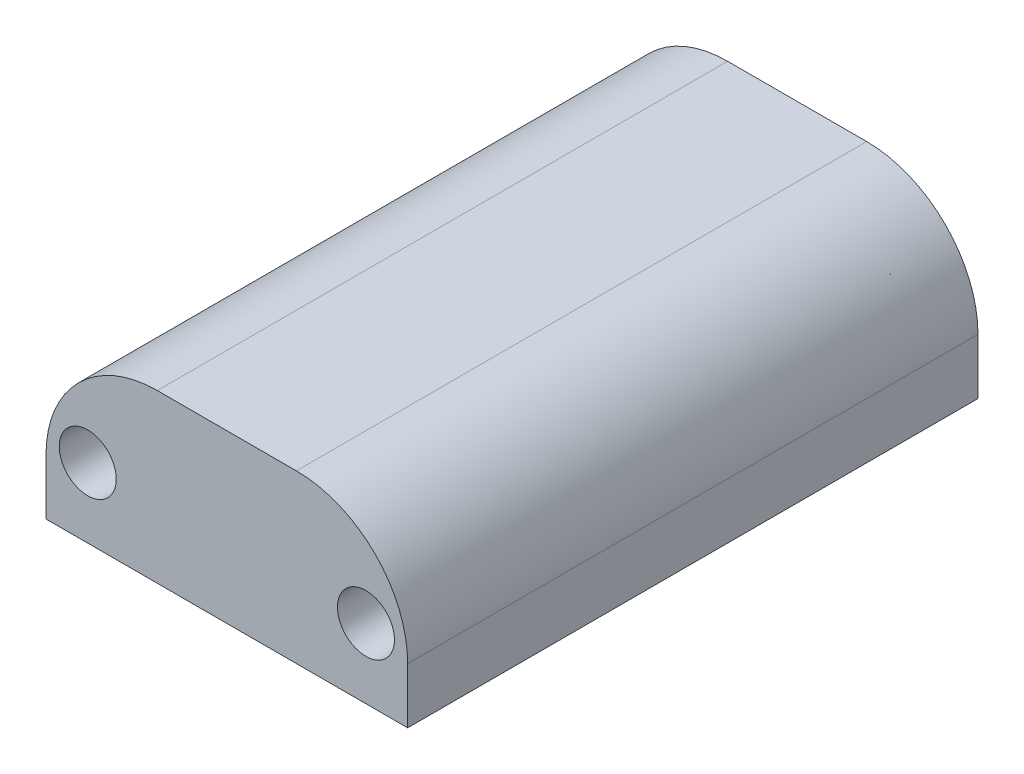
from build123d import *

# Parameters (mm, degrees)
SKETCH_1_W          = 26
SKETCH_1_H          = 12
EXTRUDE_1_DEPTH     = 20.5
FILLET_1_R          = 8
SKETCH_2_R          = 2.05
CUT_EXTRUDE_1_DEPTH = 41


with BuildPart() as part:
    # Sketch 1 → Extrude 1 (new, symmetric)
    with BuildSketch(Plane.XY):
        Rectangle(SKETCH_1_W, SKETCH_1_H)
    extrude(amount=EXTRUDE_1_DEPTH, both=True)

    # Fillet 1
    fillet_1_edges = [part.edges().sort_by_distance(p)[0] for p in [
        (-13, 6, 0),
        (13, 6, 0),
    ]]
    fillet(fillet_1_edges, radius=FILLET_1_R)

    # Sketch 2 → Cut-Extrude 1 (cut)
    with BuildSketch(Plane.XY.offset(20.5)):
        with Locations((-10, -1)):
            Circle(SKETCH_2_R)
        with Locations((10, -1)):
            Circle(SKETCH_2_R)
    extrude(amount=-CUT_EXTRUDE_1_DEPTH, mode=Mode.SUBTRACT)


solid = part.part
